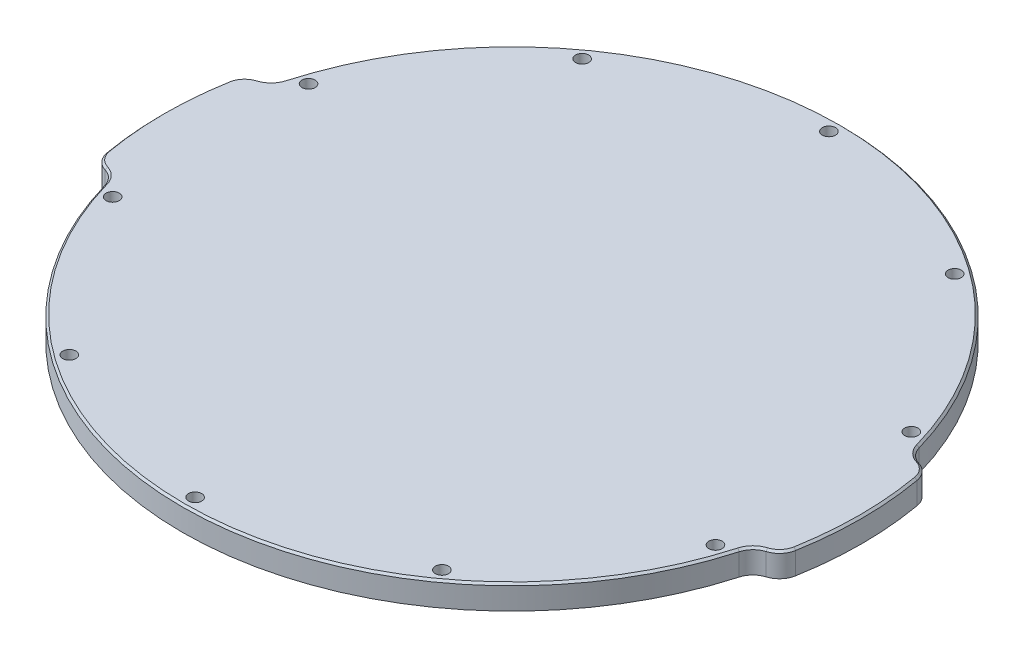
ISO-10303-21;
HEADER;
FILE_DESCRIPTION(('STEP AP214'),'2;1');
FILE_NAME('part.step','',(''),(''),'','','');
FILE_SCHEMA(('AUTOMOTIVE_DESIGN { 1 0 10303 214 1 1 1 1 }'));
ENDSEC;
DATA;
#1=APPLICATION_CONTEXT('core data for automotive mechanical design processes');
#2=APPLICATION_PROTOCOL_DEFINITION('international standard','automotive_design',2000,#1);
#3=PRODUCT_CONTEXT('',#1,'mechanical');
#4=PRODUCT('Part','Part','',(#3));
#5=PRODUCT_RELATED_PRODUCT_CATEGORY('part','',(#4));
#6=PRODUCT_DEFINITION_FORMATION('','',#4);
#7=PRODUCT_DEFINITION_CONTEXT('part definition',#1,'design');
#8=PRODUCT_DEFINITION('design','',#6,#7);
#9=PRODUCT_DEFINITION_SHAPE('','',#8);
#10=(LENGTH_UNIT() NAMED_UNIT(*) SI_UNIT(.MILLI.,.METRE.));
#11=(NAMED_UNIT(*) PLANE_ANGLE_UNIT() SI_UNIT($,.RADIAN.));
#12=(NAMED_UNIT(*) SI_UNIT($,.STERADIAN.) SOLID_ANGLE_UNIT());
#13=UNCERTAINTY_MEASURE_WITH_UNIT(LENGTH_MEASURE(1.E-05),#10,'distance_accuracy_value','');
#14=(GEOMETRIC_REPRESENTATION_CONTEXT(3) GLOBAL_UNCERTAINTY_ASSIGNED_CONTEXT((#13)) GLOBAL_UNIT_ASSIGNED_CONTEXT((#10,
#11,#12)) REPRESENTATION_CONTEXT('',''));
#15=CARTESIAN_POINT('',(0.,0.,0.));
#16=DIRECTION('',(0.,0.,1.));
#17=DIRECTION('',(1.,0.,0.));
#18=AXIS2_PLACEMENT_3D('',#15,#16,#17);
#19=CARTESIAN_POINT('',(-40.6479400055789,6.,-7.16732853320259));
#20=DIRECTION('',(0.,-1.,0.));
#21=DIRECTION('',(0.,0.,-1.));
#22=AXIS2_PLACEMENT_3D('',#19,#20,#21);
#23=PLANE('',#22);
#24=CARTESIAN_POINT('',(-84.2258492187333,6.,23.8957909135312));
#25=DIRECTION('',(0.,-1.,0.));
#26=DIRECTION('',(0.,0.,-1.));
#27=AXIS2_PLACEMENT_3D('',#24,#25,#26);
#28=CIRCLE('',#27,5.49999999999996);
#29=CARTESIAN_POINT('',(-82.6143661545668,6.,18.6371672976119));
#30=VERTEX_POINT('',#29);
#31=CARTESIAN_POINT('',(-78.9346765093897,6.,22.3946275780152));
#32=VERTEX_POINT('',#31);
#33=EDGE_CURVE('E296',#30,#32,#28,.T.);
#34=ORIENTED_EDGE('',*,*,#33,.T.);
#35=CARTESIAN_POINT('',(0.,6.,-4.92661467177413E-13));
#36=DIRECTION('',(0.,-1.,0.));
#37=DIRECTION('',(0.,0.,-1.));
#38=AXIS2_PLACEMENT_3D('',#35,#36,#37);
#39=CIRCLE('',#38,82.0500000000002);
#40=CARTESIAN_POINT('',(78.9346765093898,6.,22.3946275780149));
#41=VERTEX_POINT('',#40);
#42=EDGE_CURVE('E302',#32,#41,#39,.F.);
#43=ORIENTED_EDGE('',*,*,#42,.T.);
#44=CARTESIAN_POINT('',(84.2258492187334,6.,23.8957909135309));
#45=DIRECTION('',(0.,-1.,0.));
#46=DIRECTION('',(0.,0.,-1.));
#47=AXIS2_PLACEMENT_3D('',#44,#45,#46);
#48=CIRCLE('',#47,5.49999999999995);
#49=CARTESIAN_POINT('',(82.6143661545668,6.,18.6371672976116));
#50=VERTEX_POINT('',#49);
#51=EDGE_CURVE('E299',#41,#50,#48,.T.);
#52=ORIENTED_EDGE('',*,*,#51,.T.);
#53=CARTESIAN_POINT('',(81.2958800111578,6.,14.3346570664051));
#54=DIRECTION('',(0.,-1.,0.));
#55=DIRECTION('',(0.,0.,-1.));
#56=AXIS2_PLACEMENT_3D('',#53,#54,#55);
#57=CIRCLE('',#56,4.49999999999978);
#58=CARTESIAN_POINT('',(85.7275148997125,6.,15.1160738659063));
#59=VERTEX_POINT('',#58);
#60=EDGE_CURVE('E293',#50,#59,#57,.F.);
#61=ORIENTED_EDGE('',*,*,#60,.T.);
#62=CARTESIAN_POINT('',(-1.29063426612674E-12,6.,0.));
#63=DIRECTION('',(0.,-1.,0.));
#64=DIRECTION('',(0.,0.,-1.));
#65=AXIS2_PLACEMENT_3D('',#62,#63,#64);
#66=CIRCLE('',#65,87.0500000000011);
#67=CARTESIAN_POINT('',(85.7275148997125,6.,-15.1160738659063));
#68=VERTEX_POINT('',#67);
#69=EDGE_CURVE('E287',#59,#68,#66,.F.);
#70=ORIENTED_EDGE('',*,*,#69,.T.);
#71=CARTESIAN_POINT('',(81.2958800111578,6.,-14.3346570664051));
#72=DIRECTION('',(0.,-1.,0.));
#73=DIRECTION('',(0.,0.,-1.));
#74=AXIS2_PLACEMENT_3D('',#71,#72,#73);
#75=CIRCLE('',#74,4.49999999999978);
#76=CARTESIAN_POINT('',(82.6143661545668,6.,-18.6371672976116));
#77=VERTEX_POINT('',#76);
#78=EDGE_CURVE('E281',#68,#77,#75,.F.);
#79=ORIENTED_EDGE('',*,*,#78,.T.);
#80=CARTESIAN_POINT('',(84.2258492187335,6.,-23.8957909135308));
#81=DIRECTION('',(0.,-1.,0.));
#82=DIRECTION('',(0.,0.,-1.));
#83=AXIS2_PLACEMENT_3D('',#80,#81,#82);
#84=CIRCLE('',#83,5.49999999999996);
#85=CARTESIAN_POINT('',(78.9346765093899,6.,-22.3946275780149));
#86=VERTEX_POINT('',#85);
#87=EDGE_CURVE('E275',#77,#86,#84,.T.);
#88=ORIENTED_EDGE('',*,*,#87,.T.);
#89=CARTESIAN_POINT('',(0.,6.,0.));
#90=DIRECTION('',(0.,-1.,0.));
#91=DIRECTION('',(0.,0.,-1.));
#92=AXIS2_PLACEMENT_3D('',#89,#90,#91);
#93=CIRCLE('',#92,82.05);
#94=CARTESIAN_POINT('',(-78.9346765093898,6.,-22.3946275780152));
#95=VERTEX_POINT('',#94);
#96=EDGE_CURVE('E269',#86,#95,#93,.F.);
#97=ORIENTED_EDGE('',*,*,#96,.T.);
#98=CARTESIAN_POINT('',(-84.2258492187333,6.,-23.8957909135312));
#99=DIRECTION('',(0.,-1.,0.));
#100=DIRECTION('',(0.,0.,-1.));
#101=AXIS2_PLACEMENT_3D('',#98,#99,#100);
#102=CIRCLE('',#101,5.49999999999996);
#103=CARTESIAN_POINT('',(-82.6143661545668,6.,-18.6371672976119));
#104=VERTEX_POINT('',#103);
#105=EDGE_CURVE('E272',#95,#104,#102,.T.);
#106=ORIENTED_EDGE('',*,*,#105,.T.);
#107=CARTESIAN_POINT('',(-81.2958800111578,6.,-14.3346570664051));
#108=DIRECTION('',(0.,-1.,0.));
#109=DIRECTION('',(0.,0.,-1.));
#110=AXIS2_PLACEMENT_3D('',#107,#108,#109);
#111=CIRCLE('',#110,4.50000000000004);
#112=CARTESIAN_POINT('',(-85.7275148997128,6.,-15.1160738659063));
#113=VERTEX_POINT('',#112);
#114=EDGE_CURVE('E278',#104,#113,#111,.F.);
#115=ORIENTED_EDGE('',*,*,#114,.T.);
#116=CARTESIAN_POINT('',(0.,6.,0.));
#117=DIRECTION('',(0.,-1.,0.));
#118=DIRECTION('',(0.,0.,-1.));
#119=AXIS2_PLACEMENT_3D('',#116,#117,#118);
#120=CIRCLE('',#119,87.05);
#121=CARTESIAN_POINT('',(-85.7275148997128,6.,15.1160738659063));
#122=VERTEX_POINT('',#121);
#123=EDGE_CURVE('E284',#113,#122,#120,.F.);
#124=ORIENTED_EDGE('',*,*,#123,.T.);
#125=CARTESIAN_POINT('',(-81.2958800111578,6.,14.3346570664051));
#126=DIRECTION('',(0.,-1.,0.));
#127=DIRECTION('',(0.,0.,-1.));
#128=AXIS2_PLACEMENT_3D('',#125,#126,#127);
#129=CIRCLE('',#128,4.50000000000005);
#130=EDGE_CURVE('E290',#122,#30,#129,.F.);
#131=ORIENTED_EDGE('',*,*,#130,.T.);
#132=EDGE_LOOP('',(#34,#43,#52,#61,#70,#79,#88,#97,#106,#115,#124,#131));
#133=FACE_BOUND('',#132,.T.);
#134=CARTESIAN_POINT('',(-75.4663345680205,6.,-24.5204985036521));
#135=DIRECTION('',(0.,1.,0.));
#136=DIRECTION('',(0.,0.,1.));
#137=AXIS2_PLACEMENT_3D('',#134,#135,#136);
#138=CIRCLE('',#137,1.6500000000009);
#139=CARTESIAN_POINT('',(-75.4663345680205,6.,-22.8704985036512));
#140=VERTEX_POINT('',#139);
#141=EDGE_CURVE('E400',#140,#140,#138,.T.);
#142=ORIENTED_EDGE('',*,*,#141,.F.);
#143=EDGE_LOOP('',(#142));
#144=FACE_BOUND('',#143,.T.);
#145=CARTESIAN_POINT('',(-46.6407597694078,6.,64.1954985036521));
#146=DIRECTION('',(0.,1.,0.));
#147=DIRECTION('',(0.,0.,1.));
#148=AXIS2_PLACEMENT_3D('',#145,#146,#147);
#149=CIRCLE('',#148,1.65000000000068);
#150=CARTESIAN_POINT('',(-46.6407597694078,6.,65.8454985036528));
#151=VERTEX_POINT('',#150);
#152=EDGE_CURVE('E416',#151,#151,#149,.T.);
#153=ORIENTED_EDGE('',*,*,#152,.F.);
#154=EDGE_LOOP('',(#153));
#155=FACE_BOUND('',#154,.T.);
#156=CARTESIAN_POINT('',(46.6407597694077,6.,64.1954985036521));
#157=DIRECTION('',(0.,1.,0.));
#158=DIRECTION('',(0.,0.,1.));
#159=AXIS2_PLACEMENT_3D('',#156,#157,#158);
#160=CIRCLE('',#159,1.65000000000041);
#161=CARTESIAN_POINT('',(46.6407597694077,6.,65.8454985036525));
#162=VERTEX_POINT('',#161);
#163=EDGE_CURVE('E431',#162,#162,#160,.T.);
#164=ORIENTED_EDGE('',*,*,#163,.F.);
#165=EDGE_LOOP('',(#164));
#166=FACE_BOUND('',#165,.T.);
#167=CARTESIAN_POINT('',(75.4663345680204,6.,-24.5204985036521));
#168=DIRECTION('',(0.,1.,0.));
#169=DIRECTION('',(0.,0.,1.));
#170=AXIS2_PLACEMENT_3D('',#167,#168,#169);
#171=CIRCLE('',#170,1.65000000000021);
#172=CARTESIAN_POINT('',(75.4663345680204,6.,-22.8704985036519));
#173=VERTEX_POINT('',#172);
#174=EDGE_CURVE('E447',#173,#173,#171,.T.);
#175=ORIENTED_EDGE('',*,*,#174,.F.);
#176=EDGE_LOOP('',(#175));
#177=FACE_BOUND('',#176,.T.);
#178=CARTESIAN_POINT('',(0.,6.,-79.35));
#179=DIRECTION('',(0.,1.,0.));
#180=DIRECTION('',(0.,0.,1.));
#181=AXIS2_PLACEMENT_3D('',#178,#179,#180);
#182=CIRCLE('',#181,1.65);
#183=CARTESIAN_POINT('',(0.,6.,-77.7));
#184=VERTEX_POINT('',#183);
#185=EDGE_CURVE('E192',#184,#184,#182,.T.);
#186=ORIENTED_EDGE('',*,*,#185,.F.);
#187=EDGE_LOOP('',(#186));
#188=FACE_BOUND('',#187,.T.);
#189=CARTESIAN_POINT('',(46.6407597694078,6.,-64.1954985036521));
#190=DIRECTION('',(0.,1.,0.));
#191=DIRECTION('',(0.,0.,1.));
#192=AXIS2_PLACEMENT_3D('',#189,#190,#191);
#193=CIRCLE('',#192,1.65000000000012);
#194=CARTESIAN_POINT('',(46.6407597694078,6.,-62.5454985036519));
#195=VERTEX_POINT('',#194);
#196=EDGE_CURVE('E455',#195,#195,#193,.T.);
#197=ORIENTED_EDGE('',*,*,#196,.F.);
#198=EDGE_LOOP('',(#197));
#199=FACE_BOUND('',#198,.T.);
#200=CARTESIAN_POINT('',(75.4663345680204,6.,24.5204985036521));
#201=DIRECTION('',(0.,1.,0.));
#202=DIRECTION('',(0.,0.,1.));
#203=AXIS2_PLACEMENT_3D('',#200,#201,#202);
#204=CIRCLE('',#203,1.65000000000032);
#205=CARTESIAN_POINT('',(75.4663345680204,6.,26.1704985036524));
#206=VERTEX_POINT('',#205);
#207=EDGE_CURVE('E439',#206,#206,#204,.T.);
#208=ORIENTED_EDGE('',*,*,#207,.F.);
#209=EDGE_LOOP('',(#208));
#210=FACE_BOUND('',#209,.T.);
#211=CARTESIAN_POINT('',(0.,6.,79.35));
#212=DIRECTION('',(0.,1.,0.));
#213=DIRECTION('',(0.,0.,1.));
#214=AXIS2_PLACEMENT_3D('',#211,#212,#213);
#215=CIRCLE('',#214,1.65000000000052);
#216=CARTESIAN_POINT('',(0.,6.,81.0000000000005));
#217=VERTEX_POINT('',#216);
#218=EDGE_CURVE('E424',#217,#217,#215,.T.);
#219=ORIENTED_EDGE('',*,*,#218,.F.);
#220=EDGE_LOOP('',(#219));
#221=FACE_BOUND('',#220,.T.);
#222=CARTESIAN_POINT('',(-75.4663345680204,6.,24.5204985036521));
#223=DIRECTION('',(0.,1.,0.));
#224=DIRECTION('',(0.,0.,1.));
#225=AXIS2_PLACEMENT_3D('',#222,#223,#224);
#226=CIRCLE('',#225,1.65000000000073);
#227=CARTESIAN_POINT('',(-75.4663345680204,6.,26.1704985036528));
#228=VERTEX_POINT('',#227);
#229=EDGE_CURVE('E408',#228,#228,#226,.T.);
#230=ORIENTED_EDGE('',*,*,#229,.F.);
#231=EDGE_LOOP('',(#230));
#232=FACE_BOUND('',#231,.T.);
#233=CARTESIAN_POINT('',(-46.6407597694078,6.,-64.1954985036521));
#234=DIRECTION('',(0.,1.,0.));
#235=DIRECTION('',(0.,0.,1.));
#236=AXIS2_PLACEMENT_3D('',#233,#234,#235);
#237=CIRCLE('',#236,1.65000000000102);
#238=CARTESIAN_POINT('',(-46.6407597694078,6.,-62.545498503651));
#239=VERTEX_POINT('',#238);
#240=EDGE_CURVE('E390',#239,#239,#237,.T.);
#241=ORIENTED_EDGE('',*,*,#240,.F.);
#242=EDGE_LOOP('',(#241));
#243=FACE_BOUND('',#242,.T.);
#244=ADVANCED_FACE('F43',(#133,#144,#155,#166,#177,#188,#199,#210,#221,#232,#243),#23,.F.);
#245=CARTESIAN_POINT('',(-40.6479400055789,0.,-7.16732853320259));
#246=DIRECTION('',(0.,-1.,0.));
#247=DIRECTION('',(0.,0.,-1.));
#248=AXIS2_PLACEMENT_3D('',#245,#246,#247);
#249=PLANE('',#248);
#250=CARTESIAN_POINT('',(-75.4663345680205,0.,-24.5204985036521));
#251=DIRECTION('',(0.,1.,0.));
#252=DIRECTION('',(0.,0.,1.));
#253=AXIS2_PLACEMENT_3D('',#250,#251,#252);
#254=CIRCLE('',#253,1.6500000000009);
#255=CARTESIAN_POINT('',(-75.4663345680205,0.,-22.8704985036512));
#256=VERTEX_POINT('',#255);
#257=EDGE_CURVE('E397',#256,#256,#254,.T.);
#258=ORIENTED_EDGE('',*,*,#257,.T.);
#259=EDGE_LOOP('',(#258));
#260=FACE_BOUND('',#259,.T.);
#261=CARTESIAN_POINT('',(-46.6407597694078,0.,64.1954985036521));
#262=DIRECTION('',(0.,1.,0.));
#263=DIRECTION('',(0.,0.,1.));
#264=AXIS2_PLACEMENT_3D('',#261,#262,#263);
#265=CIRCLE('',#264,1.65000000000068);
#266=CARTESIAN_POINT('',(-46.6407597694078,0.,65.8454985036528));
#267=VERTEX_POINT('',#266);
#268=EDGE_CURVE('E412',#267,#267,#265,.T.);
#269=ORIENTED_EDGE('',*,*,#268,.T.);
#270=EDGE_LOOP('',(#269));
#271=FACE_BOUND('',#270,.T.);
#272=CARTESIAN_POINT('',(46.6407597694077,0.,64.1954985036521));
#273=DIRECTION('',(0.,1.,0.));
#274=DIRECTION('',(0.,0.,1.));
#275=AXIS2_PLACEMENT_3D('',#272,#273,#274);
#276=CIRCLE('',#275,1.65000000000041);
#277=CARTESIAN_POINT('',(46.6407597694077,0.,65.8454985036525));
#278=VERTEX_POINT('',#277);
#279=EDGE_CURVE('E427',#278,#278,#276,.T.);
#280=ORIENTED_EDGE('',*,*,#279,.T.);
#281=EDGE_LOOP('',(#280));
#282=FACE_BOUND('',#281,.T.);
#283=CARTESIAN_POINT('',(75.4663345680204,0.,-24.5204985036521));
#284=DIRECTION('',(0.,1.,0.));
#285=DIRECTION('',(0.,0.,1.));
#286=AXIS2_PLACEMENT_3D('',#283,#284,#285);
#287=CIRCLE('',#286,1.65000000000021);
#288=CARTESIAN_POINT('',(75.4663345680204,0.,-22.8704985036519));
#289=VERTEX_POINT('',#288);
#290=EDGE_CURVE('E443',#289,#289,#287,.T.);
#291=ORIENTED_EDGE('',*,*,#290,.T.);
#292=EDGE_LOOP('',(#291));
#293=FACE_BOUND('',#292,.T.);
#294=CARTESIAN_POINT('',(0.,0.,-79.35));
#295=DIRECTION('',(0.,1.,0.));
#296=DIRECTION('',(0.,0.,1.));
#297=AXIS2_PLACEMENT_3D('',#294,#295,#296);
#298=CIRCLE('',#297,1.65);
#299=CARTESIAN_POINT('',(0.,0.,-77.7));
#300=VERTEX_POINT('',#299);
#301=EDGE_CURVE('E459',#300,#300,#298,.T.);
#302=ORIENTED_EDGE('',*,*,#301,.T.);
#303=EDGE_LOOP('',(#302));
#304=FACE_BOUND('',#303,.T.);
#305=CARTESIAN_POINT('',(-81.2958800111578,0.,-14.3346570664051));
#306=DIRECTION('',(0.,1.,0.));
#307=DIRECTION('',(0.,0.,-1.));
#308=AXIS2_PLACEMENT_3D('',#305,#306,#307);
#309=CIRCLE('',#308,5.00000000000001);
#310=CARTESIAN_POINT('',(-82.7608646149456,0.,-19.1152239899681));
#311=VERTEX_POINT('',#310);
#312=CARTESIAN_POINT('',(-86.2199187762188,0.,-15.2028979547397));
#313=VERTEX_POINT('',#312);
#314=EDGE_CURVE('E186',#311,#313,#309,.T.);
#315=ORIENTED_EDGE('',*,*,#314,.F.);
#316=CARTESIAN_POINT('',(-84.2258492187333,0.,-23.8957909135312));
#317=DIRECTION('',(0.,-1.,0.));
#318=DIRECTION('',(0.,0.,-1.));
#319=AXIS2_PLACEMENT_3D('',#316,#317,#318);
#320=CIRCLE('',#319,5.);
#321=CARTESIAN_POINT('',(-79.4156922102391,0.,-22.531096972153));
#322=VERTEX_POINT('',#321);
#323=EDGE_CURVE('E263',#311,#322,#320,.F.);
#324=ORIENTED_EDGE('',*,*,#323,.T.);
#325=CARTESIAN_POINT('',(0.,0.,0.));
#326=DIRECTION('',(0.,1.,0.));
#327=DIRECTION('',(0.,0.,-1.));
#328=AXIS2_PLACEMENT_3D('',#325,#326,#327);
#329=CIRCLE('',#328,82.55);
#330=CARTESIAN_POINT('',(79.4156922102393,0.,-22.5310969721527));
#331=VERTEX_POINT('',#330);
#332=EDGE_CURVE('E222',#331,#322,#329,.T.);
#333=ORIENTED_EDGE('',*,*,#332,.F.);
#334=CARTESIAN_POINT('',(84.2258492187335,0.,-23.8957909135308));
#335=DIRECTION('',(0.,-1.,0.));
#336=DIRECTION('',(0.,0.,-1.));
#337=AXIS2_PLACEMENT_3D('',#334,#335,#336);
#338=CIRCLE('',#337,5.);
#339=CARTESIAN_POINT('',(82.7608646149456,0.,-19.1152239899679));
#340=VERTEX_POINT('',#339);
#341=EDGE_CURVE('E260',#331,#340,#338,.F.);
#342=ORIENTED_EDGE('',*,*,#341,.T.);
#343=CARTESIAN_POINT('',(81.2958800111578,0.,-14.3346570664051));
#344=DIRECTION('',(0.,1.,0.));
#345=DIRECTION('',(0.,0.,1.));
#346=AXIS2_PLACEMENT_3D('',#343,#344,#345);
#347=CIRCLE('',#346,4.99999999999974);
#348=CARTESIAN_POINT('',(86.2199187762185,0.,-15.2028979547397));
#349=VERTEX_POINT('',#348);
#350=EDGE_CURVE('E218',#349,#340,#347,.T.);
#351=ORIENTED_EDGE('',*,*,#350,.F.);
#352=CARTESIAN_POINT('',(-1.29063426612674E-12,0.,0.));
#353=DIRECTION('',(0.,1.,0.));
#354=DIRECTION('',(0.,0.,1.));
#355=AXIS2_PLACEMENT_3D('',#352,#353,#354);
#356=CIRCLE('',#355,87.550000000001);
#357=CARTESIAN_POINT('',(86.2199187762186,0.,15.2028979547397));
#358=VERTEX_POINT('',#357);
#359=EDGE_CURVE('E214',#358,#349,#356,.T.);
#360=ORIENTED_EDGE('',*,*,#359,.F.);
#361=CARTESIAN_POINT('',(81.2958800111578,0.,14.3346570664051));
#362=DIRECTION('',(0.,1.,0.));
#363=DIRECTION('',(0.,0.,-1.));
#364=AXIS2_PLACEMENT_3D('',#361,#362,#363);
#365=CIRCLE('',#364,4.99999999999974);
#366=CARTESIAN_POINT('',(82.7608646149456,0.,19.1152239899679));
#367=VERTEX_POINT('',#366);
#368=EDGE_CURVE('E210',#367,#358,#365,.T.);
#369=ORIENTED_EDGE('',*,*,#368,.F.);
#370=CARTESIAN_POINT('',(84.2258492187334,0.,23.8957909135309));
#371=DIRECTION('',(0.,-1.,0.));
#372=DIRECTION('',(0.,0.,-1.));
#373=AXIS2_PLACEMENT_3D('',#370,#371,#372);
#374=CIRCLE('',#373,5.);
#375=CARTESIAN_POINT('',(79.4156922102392,0.,22.5310969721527));
#376=VERTEX_POINT('',#375);
#377=EDGE_CURVE('E257',#367,#376,#374,.F.);
#378=ORIENTED_EDGE('',*,*,#377,.T.);
#379=CARTESIAN_POINT('',(0.,0.,-4.92661467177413E-13));
#380=DIRECTION('',(0.,1.,0.));
#381=DIRECTION('',(0.,0.,-1.));
#382=AXIS2_PLACEMENT_3D('',#379,#380,#381);
#383=CIRCLE('',#382,82.5500000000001);
#384=CARTESIAN_POINT('',(-79.4156922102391,0.,22.531096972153));
#385=VERTEX_POINT('',#384);
#386=EDGE_CURVE('E203',#385,#376,#383,.T.);
#387=ORIENTED_EDGE('',*,*,#386,.F.);
#388=CARTESIAN_POINT('',(-84.2258492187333,0.,23.8957909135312));
#389=DIRECTION('',(0.,-1.,0.));
#390=DIRECTION('',(0.,0.,-1.));
#391=AXIS2_PLACEMENT_3D('',#388,#389,#390);
#392=CIRCLE('',#391,5.);
#393=CARTESIAN_POINT('',(-82.7608646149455,0.,19.1152239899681));
#394=VERTEX_POINT('',#393);
#395=EDGE_CURVE('E266',#385,#394,#392,.F.);
#396=ORIENTED_EDGE('',*,*,#395,.T.);
#397=CARTESIAN_POINT('',(-81.2958800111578,0.,14.3346570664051));
#398=DIRECTION('',(0.,1.,0.));
#399=DIRECTION('',(0.,0.,1.));
#400=AXIS2_PLACEMENT_3D('',#397,#398,#399);
#401=CIRCLE('',#400,5.00000000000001);
#402=CARTESIAN_POINT('',(-86.2199187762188,0.,15.2028979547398));
#403=VERTEX_POINT('',#402);
#404=EDGE_CURVE('E197',#403,#394,#401,.T.);
#405=ORIENTED_EDGE('',*,*,#404,.F.);
#406=CARTESIAN_POINT('',(0.,0.,0.));
#407=DIRECTION('',(0.,1.,0.));
#408=DIRECTION('',(0.,0.,-1.));
#409=AXIS2_PLACEMENT_3D('',#406,#407,#408);
#410=CIRCLE('',#409,87.55);
#411=EDGE_CURVE('E175',#313,#403,#410,.T.);
#412=ORIENTED_EDGE('',*,*,#411,.F.);
#413=EDGE_LOOP('',(#315,#324,#333,#342,#351,#360,#369,#378,#387,#396,#405,#412));
#414=FACE_BOUND('',#413,.T.);
#415=CARTESIAN_POINT('',(46.6407597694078,0.,-64.1954985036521));
#416=DIRECTION('',(0.,1.,0.));
#417=DIRECTION('',(0.,0.,1.));
#418=AXIS2_PLACEMENT_3D('',#415,#416,#417);
#419=CIRCLE('',#418,1.65000000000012);
#420=CARTESIAN_POINT('',(46.6407597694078,0.,-62.5454985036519));
#421=VERTEX_POINT('',#420);
#422=EDGE_CURVE('E451',#421,#421,#419,.T.);
#423=ORIENTED_EDGE('',*,*,#422,.T.);
#424=EDGE_LOOP('',(#423));
#425=FACE_BOUND('',#424,.T.);
#426=CARTESIAN_POINT('',(75.4663345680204,0.,24.5204985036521));
#427=DIRECTION('',(0.,1.,0.));
#428=DIRECTION('',(0.,0.,1.));
#429=AXIS2_PLACEMENT_3D('',#426,#427,#428);
#430=CIRCLE('',#429,1.65000000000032);
#431=CARTESIAN_POINT('',(75.4663345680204,0.,26.1704985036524));
#432=VERTEX_POINT('',#431);
#433=EDGE_CURVE('E435',#432,#432,#430,.T.);
#434=ORIENTED_EDGE('',*,*,#433,.T.);
#435=EDGE_LOOP('',(#434));
#436=FACE_BOUND('',#435,.T.);
#437=CARTESIAN_POINT('',(0.,0.,79.35));
#438=DIRECTION('',(0.,1.,0.));
#439=DIRECTION('',(0.,0.,1.));
#440=AXIS2_PLACEMENT_3D('',#437,#438,#439);
#441=CIRCLE('',#440,1.65000000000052);
#442=CARTESIAN_POINT('',(0.,0.,81.0000000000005));
#443=VERTEX_POINT('',#442);
#444=EDGE_CURVE('E420',#443,#443,#441,.T.);
#445=ORIENTED_EDGE('',*,*,#444,.T.);
#446=EDGE_LOOP('',(#445));
#447=FACE_BOUND('',#446,.T.);
#448=CARTESIAN_POINT('',(-75.4663345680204,0.,24.5204985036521));
#449=DIRECTION('',(0.,1.,0.));
#450=DIRECTION('',(0.,0.,1.));
#451=AXIS2_PLACEMENT_3D('',#448,#449,#450);
#452=CIRCLE('',#451,1.65000000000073);
#453=CARTESIAN_POINT('',(-75.4663345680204,0.,26.1704985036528));
#454=VERTEX_POINT('',#453);
#455=EDGE_CURVE('E404',#454,#454,#452,.T.);
#456=ORIENTED_EDGE('',*,*,#455,.T.);
#457=EDGE_LOOP('',(#456));
#458=FACE_BOUND('',#457,.T.);
#459=CARTESIAN_POINT('',(-46.6407597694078,0.,-64.1954985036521));
#460=DIRECTION('',(0.,1.,0.));
#461=DIRECTION('',(0.,0.,1.));
#462=AXIS2_PLACEMENT_3D('',#459,#460,#461);
#463=CIRCLE('',#462,1.65000000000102);
#464=CARTESIAN_POINT('',(-46.6407597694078,0.,-62.545498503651));
#465=VERTEX_POINT('',#464);
#466=EDGE_CURVE('E384',#465,#465,#463,.T.);
#467=ORIENTED_EDGE('',*,*,#466,.T.);
#468=EDGE_LOOP('',(#467));
#469=FACE_BOUND('',#468,.T.);
#470=ADVANCED_FACE('F194',(#260,#271,#282,#293,#304,#414,#425,#436,#447,#458,#469),#249,.T.);
#471=CARTESIAN_POINT('',(-81.2958800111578,6.,-14.3346570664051));
#472=DIRECTION('',(0.,-1.,0.));
#473=DIRECTION('',(0.,0.,-1.));
#474=AXIS2_PLACEMENT_3D('',#471,#472,#473);
#475=CYLINDRICAL_SURFACE('',#474,5.00000000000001);
#476=DIRECTION('',(0.,-1.,0.));
#477=VECTOR('',#476,1.);
#478=CARTESIAN_POINT('',(-86.2199187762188,6.,-15.2028979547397));
#479=LINE('',#478,#477);
#480=CARTESIAN_POINT('',(-86.2199187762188,5.50000000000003,-15.2028979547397));
#481=VERTEX_POINT('',#480);
#482=EDGE_CURVE('E170',#481,#313,#479,.T.);
#483=ORIENTED_EDGE('',*,*,#482,.F.);
#484=CARTESIAN_POINT('',(-81.2958800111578,5.50000000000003,-14.3346570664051));
#485=DIRECTION('',(0.,-1.,0.));
#486=DIRECTION('',(0.,0.,-1.));
#487=AXIS2_PLACEMENT_3D('',#484,#485,#486);
#488=CIRCLE('',#487,5.00000000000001);
#489=CARTESIAN_POINT('',(-82.7608646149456,5.50000000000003,-19.1152239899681));
#490=VERTEX_POINT('',#489);
#491=EDGE_CURVE('E330',#481,#490,#488,.T.);
#492=ORIENTED_EDGE('',*,*,#491,.T.);
#493=DIRECTION('',(0.,-1.,0.));
#494=VECTOR('',#493,1.);
#495=CARTESIAN_POINT('',(-82.7608646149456,6.,-19.1152239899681));
#496=LINE('',#495,#494);
#497=EDGE_CURVE('E188',#490,#311,#496,.T.);
#498=ORIENTED_EDGE('',*,*,#497,.T.);
#499=ORIENTED_EDGE('',*,*,#314,.T.);
#500=EDGE_LOOP('',(#483,#492,#498,#499));
#501=FACE_BOUND('',#500,.T.);
#502=ADVANCED_FACE('F187',(#501),#475,.T.);
#503=CARTESIAN_POINT('',(0.,6.,0.));
#504=DIRECTION('',(0.,-1.,0.));
#505=DIRECTION('',(0.,0.,-1.));
#506=AXIS2_PLACEMENT_3D('',#503,#504,#505);
#507=CYLINDRICAL_SURFACE('',#506,87.55);
#508=DIRECTION('',(0.,-1.,0.));
#509=VECTOR('',#508,1.);
#510=CARTESIAN_POINT('',(-86.2199187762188,6.,15.2028979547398));
#511=LINE('',#510,#509);
#512=CARTESIAN_POINT('',(-86.2199187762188,5.50000000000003,15.2028979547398));
#513=VERTEX_POINT('',#512);
#514=EDGE_CURVE('E183',#513,#403,#511,.T.);
#515=ORIENTED_EDGE('',*,*,#514,.F.);
#516=CARTESIAN_POINT('',(0.,5.50000000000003,0.));
#517=DIRECTION('',(0.,-1.,0.));
#518=DIRECTION('',(0.,0.,-1.));
#519=AXIS2_PLACEMENT_3D('',#516,#517,#518);
#520=CIRCLE('',#519,87.55);
#521=EDGE_CURVE('E178',#513,#481,#520,.T.);
#522=ORIENTED_EDGE('',*,*,#521,.T.);
#523=ORIENTED_EDGE('',*,*,#482,.T.);
#524=ORIENTED_EDGE('',*,*,#411,.T.);
#525=EDGE_LOOP('',(#515,#522,#523,#524));
#526=FACE_BOUND('',#525,.T.);
#527=ADVANCED_FACE('F173',(#526),#507,.T.);
#528=CARTESIAN_POINT('',(-81.2958800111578,6.,14.3346570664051));
#529=DIRECTION('',(0.,-1.,0.));
#530=DIRECTION('',(0.,0.,-1.));
#531=AXIS2_PLACEMENT_3D('',#528,#529,#530);
#532=CYLINDRICAL_SURFACE('',#531,5.00000000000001);
#533=DIRECTION('',(0.,-1.,0.));
#534=VECTOR('',#533,1.);
#535=CARTESIAN_POINT('',(-82.7608646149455,6.,19.1152239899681));
#536=LINE('',#535,#534);
#537=CARTESIAN_POINT('',(-82.7608646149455,5.50000000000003,19.1152239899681));
#538=VERTEX_POINT('',#537);
#539=EDGE_CURVE('E253',#394,#538,#536,.F.);
#540=ORIENTED_EDGE('',*,*,#539,.T.);
#541=CARTESIAN_POINT('',(-81.2958800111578,5.50000000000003,14.3346570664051));
#542=DIRECTION('',(0.,-1.,0.));
#543=DIRECTION('',(0.,0.,-1.));
#544=AXIS2_PLACEMENT_3D('',#541,#542,#543);
#545=CIRCLE('',#544,5.00000000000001);
#546=EDGE_CURVE('E319',#538,#513,#545,.T.);
#547=ORIENTED_EDGE('',*,*,#546,.T.);
#548=ORIENTED_EDGE('',*,*,#514,.T.);
#549=ORIENTED_EDGE('',*,*,#404,.T.);
#550=EDGE_LOOP('',(#540,#547,#548,#549));
#551=FACE_BOUND('',#550,.T.);
#552=ADVANCED_FACE('F509',(#551),#532,.T.);
#553=CARTESIAN_POINT('',(0.,6.,-4.92661467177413E-13));
#554=DIRECTION('',(0.,-1.,0.));
#555=DIRECTION('',(0.,0.,-1.));
#556=AXIS2_PLACEMENT_3D('',#553,#554,#555);
#557=CYLINDRICAL_SURFACE('',#556,82.5500000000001);
#558=DIRECTION('',(0.,-1.,0.));
#559=VECTOR('',#558,1.);
#560=CARTESIAN_POINT('',(79.4156922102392,6.,22.5310969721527));
#561=LINE('',#560,#559);
#562=CARTESIAN_POINT('',(79.4156922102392,5.50000000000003,22.5310969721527));
#563=VERTEX_POINT('',#562);
#564=EDGE_CURVE('E238',#376,#563,#561,.F.);
#565=ORIENTED_EDGE('',*,*,#564,.T.);
#566=CARTESIAN_POINT('',(0.,5.50000000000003,-4.92661467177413E-13));
#567=DIRECTION('',(0.,-1.,0.));
#568=DIRECTION('',(0.,0.,-1.));
#569=AXIS2_PLACEMENT_3D('',#566,#567,#568);
#570=CIRCLE('',#569,82.5500000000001);
#571=CARTESIAN_POINT('',(-79.4156922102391,5.50000000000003,22.531096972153));
#572=VERTEX_POINT('',#571);
#573=EDGE_CURVE('E306',#563,#572,#570,.T.);
#574=ORIENTED_EDGE('',*,*,#573,.T.);
#575=DIRECTION('',(0.,-1.,0.));
#576=VECTOR('',#575,1.);
#577=CARTESIAN_POINT('',(-79.4156922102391,6.,22.531096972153));
#578=LINE('',#577,#576);
#579=EDGE_CURVE('E235',#572,#385,#578,.T.);
#580=ORIENTED_EDGE('',*,*,#579,.T.);
#581=ORIENTED_EDGE('',*,*,#386,.T.);
#582=EDGE_LOOP('',(#565,#574,#580,#581));
#583=FACE_BOUND('',#582,.T.);
#584=ADVANCED_FACE('F505',(#583),#557,.T.);
#585=CARTESIAN_POINT('',(81.2958800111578,6.,14.3346570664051));
#586=DIRECTION('',(0.,-1.,0.));
#587=DIRECTION('',(0.,0.,-1.));
#588=AXIS2_PLACEMENT_3D('',#585,#586,#587);
#589=CYLINDRICAL_SURFACE('',#588,4.99999999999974);
#590=DIRECTION('',(0.,-1.,0.));
#591=VECTOR('',#590,1.);
#592=CARTESIAN_POINT('',(86.2199187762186,6.,15.2028979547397));
#593=LINE('',#592,#591);
#594=CARTESIAN_POINT('',(86.2199187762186,5.50000000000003,15.2028979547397));
#595=VERTEX_POINT('',#594);
#596=EDGE_CURVE('E228',#595,#358,#593,.T.);
#597=ORIENTED_EDGE('',*,*,#596,.F.);
#598=CARTESIAN_POINT('',(81.2958800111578,5.50000000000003,14.3346570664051));
#599=DIRECTION('',(0.,-1.,0.));
#600=DIRECTION('',(0.,0.,-1.));
#601=AXIS2_PLACEMENT_3D('',#598,#599,#600);
#602=CIRCLE('',#601,4.99999999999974);
#603=CARTESIAN_POINT('',(82.7608646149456,5.50000000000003,19.1152239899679));
#604=VERTEX_POINT('',#603);
#605=EDGE_CURVE('E316',#595,#604,#602,.T.);
#606=ORIENTED_EDGE('',*,*,#605,.T.);
#607=DIRECTION('',(0.,-1.,0.));
#608=VECTOR('',#607,1.);
#609=CARTESIAN_POINT('',(82.7608646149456,6.,19.1152239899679));
#610=LINE('',#609,#608);
#611=EDGE_CURVE('E182',#604,#367,#610,.T.);
#612=ORIENTED_EDGE('',*,*,#611,.T.);
#613=ORIENTED_EDGE('',*,*,#368,.T.);
#614=EDGE_LOOP('',(#597,#606,#612,#613));
#615=FACE_BOUND('',#614,.T.);
#616=ADVANCED_FACE('F501',(#615),#589,.T.);
#617=CARTESIAN_POINT('',(-1.29063426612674E-12,6.,0.));
#618=DIRECTION('',(0.,-1.,0.));
#619=DIRECTION('',(0.,0.,-1.));
#620=AXIS2_PLACEMENT_3D('',#617,#618,#619);
#621=CYLINDRICAL_SURFACE('',#620,87.550000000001);
#622=DIRECTION('',(0.,-1.,0.));
#623=VECTOR('',#622,1.);
#624=CARTESIAN_POINT('',(86.2199187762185,6.,-15.2028979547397));
#625=LINE('',#624,#623);
#626=CARTESIAN_POINT('',(86.2199187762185,5.50000000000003,-15.2028979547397));
#627=VERTEX_POINT('',#626);
#628=EDGE_CURVE('E225',#627,#349,#625,.T.);
#629=ORIENTED_EDGE('',*,*,#628,.F.);
#630=CARTESIAN_POINT('',(-1.29063426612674E-12,5.50000000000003,0.));
#631=DIRECTION('',(0.,-1.,0.));
#632=DIRECTION('',(0.,0.,-1.));
#633=AXIS2_PLACEMENT_3D('',#630,#631,#632);
#634=CIRCLE('',#633,87.550000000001);
#635=EDGE_CURVE('E322',#627,#595,#634,.T.);
#636=ORIENTED_EDGE('',*,*,#635,.T.);
#637=ORIENTED_EDGE('',*,*,#596,.T.);
#638=ORIENTED_EDGE('',*,*,#359,.T.);
#639=EDGE_LOOP('',(#629,#636,#637,#638));
#640=FACE_BOUND('',#639,.T.);
#641=ADVANCED_FACE('F497',(#640),#621,.T.);
#642=CARTESIAN_POINT('',(81.2958800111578,6.,-14.3346570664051));
#643=DIRECTION('',(0.,-1.,0.));
#644=DIRECTION('',(0.,0.,-1.));
#645=AXIS2_PLACEMENT_3D('',#642,#643,#644);
#646=CYLINDRICAL_SURFACE('',#645,4.99999999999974);
#647=DIRECTION('',(0.,-1.,0.));
#648=VECTOR('',#647,1.);
#649=CARTESIAN_POINT('',(82.7608646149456,6.,-19.1152239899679));
#650=LINE('',#649,#648);
#651=CARTESIAN_POINT('',(82.7608646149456,5.50000000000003,-19.1152239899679));
#652=VERTEX_POINT('',#651);
#653=EDGE_CURVE('E248',#340,#652,#650,.F.);
#654=ORIENTED_EDGE('',*,*,#653,.T.);
#655=CARTESIAN_POINT('',(81.2958800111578,5.50000000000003,-14.3346570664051));
#656=DIRECTION('',(0.,-1.,0.));
#657=DIRECTION('',(0.,0.,-1.));
#658=AXIS2_PLACEMENT_3D('',#655,#656,#657);
#659=CIRCLE('',#658,4.99999999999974);
#660=EDGE_CURVE('E327',#652,#627,#659,.T.);
#661=ORIENTED_EDGE('',*,*,#660,.T.);
#662=ORIENTED_EDGE('',*,*,#628,.T.);
#663=ORIENTED_EDGE('',*,*,#350,.T.);
#664=EDGE_LOOP('',(#654,#661,#662,#663));
#665=FACE_BOUND('',#664,.T.);
#666=ADVANCED_FACE('F483',(#665),#646,.T.);
#667=CARTESIAN_POINT('',(0.,6.,0.));
#668=DIRECTION('',(0.,-1.,0.));
#669=DIRECTION('',(0.,0.,-1.));
#670=AXIS2_PLACEMENT_3D('',#667,#668,#669);
#671=CYLINDRICAL_SURFACE('',#670,82.55);
#672=DIRECTION('',(0.,-1.,0.));
#673=VECTOR('',#672,1.);
#674=CARTESIAN_POINT('',(-79.4156922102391,6.,-22.531096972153));
#675=LINE('',#674,#673);
#676=CARTESIAN_POINT('',(-79.4156922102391,5.50000000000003,-22.531096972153));
#677=VERTEX_POINT('',#676);
#678=EDGE_CURVE('E242',#322,#677,#675,.F.);
#679=ORIENTED_EDGE('',*,*,#678,.T.);
#680=CARTESIAN_POINT('',(0.,5.50000000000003,0.));
#681=DIRECTION('',(0.,-1.,0.));
#682=DIRECTION('',(0.,0.,-1.));
#683=AXIS2_PLACEMENT_3D('',#680,#681,#682);
#684=CIRCLE('',#683,82.55);
#685=CARTESIAN_POINT('',(79.4156922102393,5.50000000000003,-22.5310969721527));
#686=VERTEX_POINT('',#685);
#687=EDGE_CURVE('E11',#677,#686,#684,.T.);
#688=ORIENTED_EDGE('',*,*,#687,.T.);
#689=DIRECTION('',(0.,-1.,0.));
#690=VECTOR('',#689,1.);
#691=CARTESIAN_POINT('',(79.4156922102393,6.,-22.5310969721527));
#692=LINE('',#691,#690);
#693=EDGE_CURVE('E245',#686,#331,#692,.T.);
#694=ORIENTED_EDGE('',*,*,#693,.T.);
#695=ORIENTED_EDGE('',*,*,#332,.T.);
#696=EDGE_LOOP('',(#679,#688,#694,#695));
#697=FACE_BOUND('',#696,.T.);
#698=ADVANCED_FACE('F473',(#697),#671,.T.);
#699=CARTESIAN_POINT('',(0.,6.,-79.35));
#700=DIRECTION('',(0.,-1.,0.));
#701=DIRECTION('',(0.,0.,-1.));
#702=AXIS2_PLACEMENT_3D('',#699,#700,#701);
#703=CYLINDRICAL_SURFACE('',#702,1.65);
#704=ORIENTED_EDGE('',*,*,#185,.T.);
#705=EDGE_LOOP('',(#704));
#706=FACE_BOUND('',#705,.T.);
#707=ORIENTED_EDGE('',*,*,#301,.F.);
#708=EDGE_LOOP('',(#707));
#709=FACE_BOUND('',#708,.T.);
#710=ADVANCED_FACE('F470',(#706,#709),#703,.F.);
#711=CARTESIAN_POINT('',(46.6407597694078,6.,-64.1954985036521));
#712=DIRECTION('',(0.,-1.,0.));
#713=DIRECTION('',(0.,0.,-1.));
#714=AXIS2_PLACEMENT_3D('',#711,#712,#713);
#715=CYLINDRICAL_SURFACE('',#714,1.65000000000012);
#716=ORIENTED_EDGE('',*,*,#196,.T.);
#717=EDGE_LOOP('',(#716));
#718=FACE_BOUND('',#717,.T.);
#719=ORIENTED_EDGE('',*,*,#422,.F.);
#720=EDGE_LOOP('',(#719));
#721=FACE_BOUND('',#720,.T.);
#722=ADVANCED_FACE('F472',(#718,#721),#715,.F.);
#723=CARTESIAN_POINT('',(75.4663345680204,6.,-24.5204985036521));
#724=DIRECTION('',(0.,-1.,0.));
#725=DIRECTION('',(0.,0.,-1.));
#726=AXIS2_PLACEMENT_3D('',#723,#724,#725);
#727=CYLINDRICAL_SURFACE('',#726,1.65000000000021);
#728=ORIENTED_EDGE('',*,*,#174,.T.);
#729=EDGE_LOOP('',(#728));
#730=FACE_BOUND('',#729,.T.);
#731=ORIENTED_EDGE('',*,*,#290,.F.);
#732=EDGE_LOOP('',(#731));
#733=FACE_BOUND('',#732,.T.);
#734=ADVANCED_FACE('F480',(#730,#733),#727,.F.);
#735=CARTESIAN_POINT('',(75.4663345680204,6.,24.5204985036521));
#736=DIRECTION('',(0.,-1.,0.));
#737=DIRECTION('',(0.,0.,-1.));
#738=AXIS2_PLACEMENT_3D('',#735,#736,#737);
#739=CYLINDRICAL_SURFACE('',#738,1.65000000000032);
#740=ORIENTED_EDGE('',*,*,#207,.T.);
#741=EDGE_LOOP('',(#740));
#742=FACE_BOUND('',#741,.T.);
#743=ORIENTED_EDGE('',*,*,#433,.F.);
#744=EDGE_LOOP('',(#743));
#745=FACE_BOUND('',#744,.T.);
#746=ADVANCED_FACE('F694',(#742,#745),#739,.F.);
#747=CARTESIAN_POINT('',(46.6407597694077,6.,64.1954985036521));
#748=DIRECTION('',(0.,-1.,0.));
#749=DIRECTION('',(0.,0.,-1.));
#750=AXIS2_PLACEMENT_3D('',#747,#748,#749);
#751=CYLINDRICAL_SURFACE('',#750,1.65000000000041);
#752=ORIENTED_EDGE('',*,*,#163,.T.);
#753=EDGE_LOOP('',(#752));
#754=FACE_BOUND('',#753,.T.);
#755=ORIENTED_EDGE('',*,*,#279,.F.);
#756=EDGE_LOOP('',(#755));
#757=FACE_BOUND('',#756,.T.);
#758=ADVANCED_FACE('F685',(#754,#757),#751,.F.);
#759=CARTESIAN_POINT('',(0.,6.,79.35));
#760=DIRECTION('',(0.,-1.,0.));
#761=DIRECTION('',(0.,0.,-1.));
#762=AXIS2_PLACEMENT_3D('',#759,#760,#761);
#763=CYLINDRICAL_SURFACE('',#762,1.65000000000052);
#764=ORIENTED_EDGE('',*,*,#218,.T.);
#765=EDGE_LOOP('',(#764));
#766=FACE_BOUND('',#765,.T.);
#767=ORIENTED_EDGE('',*,*,#444,.F.);
#768=EDGE_LOOP('',(#767));
#769=FACE_BOUND('',#768,.T.);
#770=ADVANCED_FACE('F676',(#766,#769),#763,.F.);
#771=CARTESIAN_POINT('',(-46.6407597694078,6.,64.1954985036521));
#772=DIRECTION('',(0.,-1.,0.));
#773=DIRECTION('',(0.,0.,-1.));
#774=AXIS2_PLACEMENT_3D('',#771,#772,#773);
#775=CYLINDRICAL_SURFACE('',#774,1.65000000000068);
#776=ORIENTED_EDGE('',*,*,#152,.T.);
#777=EDGE_LOOP('',(#776));
#778=FACE_BOUND('',#777,.T.);
#779=ORIENTED_EDGE('',*,*,#268,.F.);
#780=EDGE_LOOP('',(#779));
#781=FACE_BOUND('',#780,.T.);
#782=ADVANCED_FACE('F667',(#778,#781),#775,.F.);
#783=CARTESIAN_POINT('',(-75.4663345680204,6.,24.5204985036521));
#784=DIRECTION('',(0.,-1.,0.));
#785=DIRECTION('',(0.,0.,-1.));
#786=AXIS2_PLACEMENT_3D('',#783,#784,#785);
#787=CYLINDRICAL_SURFACE('',#786,1.65000000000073);
#788=ORIENTED_EDGE('',*,*,#229,.T.);
#789=EDGE_LOOP('',(#788));
#790=FACE_BOUND('',#789,.T.);
#791=ORIENTED_EDGE('',*,*,#455,.F.);
#792=EDGE_LOOP('',(#791));
#793=FACE_BOUND('',#792,.T.);
#794=ADVANCED_FACE('F658',(#790,#793),#787,.F.);
#795=CARTESIAN_POINT('',(-75.4663345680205,6.,-24.5204985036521));
#796=DIRECTION('',(0.,-1.,0.));
#797=DIRECTION('',(0.,0.,-1.));
#798=AXIS2_PLACEMENT_3D('',#795,#796,#797);
#799=CYLINDRICAL_SURFACE('',#798,1.6500000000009);
#800=ORIENTED_EDGE('',*,*,#141,.T.);
#801=EDGE_LOOP('',(#800));
#802=FACE_BOUND('',#801,.T.);
#803=ORIENTED_EDGE('',*,*,#257,.F.);
#804=EDGE_LOOP('',(#803));
#805=FACE_BOUND('',#804,.T.);
#806=ADVANCED_FACE('F649',(#802,#805),#799,.F.);
#807=CARTESIAN_POINT('',(-46.6407597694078,6.,-64.1954985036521));
#808=DIRECTION('',(0.,-1.,0.));
#809=DIRECTION('',(0.,0.,-1.));
#810=AXIS2_PLACEMENT_3D('',#807,#808,#809);
#811=CYLINDRICAL_SURFACE('',#810,1.65000000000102);
#812=ORIENTED_EDGE('',*,*,#240,.T.);
#813=EDGE_LOOP('',(#812));
#814=FACE_BOUND('',#813,.T.);
#815=ORIENTED_EDGE('',*,*,#466,.F.);
#816=EDGE_LOOP('',(#815));
#817=FACE_BOUND('',#816,.T.);
#818=ADVANCED_FACE('F522',(#814,#817),#811,.F.);
#819=CARTESIAN_POINT('',(84.2258492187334,6.,23.8957909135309));
#820=DIRECTION('',(0.,1.,0.));
#821=DIRECTION('',(0.,0.,1.));
#822=AXIS2_PLACEMENT_3D('',#819,#820,#821);
#823=CYLINDRICAL_SURFACE('',#822,5.);
#824=ORIENTED_EDGE('',*,*,#611,.F.);
#825=CARTESIAN_POINT('',(84.2258492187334,5.50000000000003,23.8957909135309));
#826=DIRECTION('',(0.,-1.,0.));
#827=DIRECTION('',(0.,0.,-1.));
#828=AXIS2_PLACEMENT_3D('',#825,#826,#827);
#829=CIRCLE('',#828,5.);
#830=EDGE_CURVE('E310',#604,#563,#829,.F.);
#831=ORIENTED_EDGE('',*,*,#830,.T.);
#832=ORIENTED_EDGE('',*,*,#564,.F.);
#833=ORIENTED_EDGE('',*,*,#377,.F.);
#834=EDGE_LOOP('',(#824,#831,#832,#833));
#835=FACE_BOUND('',#834,.T.);
#836=ADVANCED_FACE('F518',(#835),#823,.F.);
#837=CARTESIAN_POINT('',(84.2258492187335,6.,-23.8957909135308));
#838=DIRECTION('',(0.,1.,0.));
#839=DIRECTION('',(0.,0.,1.));
#840=AXIS2_PLACEMENT_3D('',#837,#838,#839);
#841=CYLINDRICAL_SURFACE('',#840,5.);
#842=ORIENTED_EDGE('',*,*,#693,.F.);
#843=CARTESIAN_POINT('',(84.2258492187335,5.50000000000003,-23.8957909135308));
#844=DIRECTION('',(0.,-1.,0.));
#845=DIRECTION('',(0.,0.,-1.));
#846=AXIS2_PLACEMENT_3D('',#843,#844,#845);
#847=CIRCLE('',#846,5.);
#848=EDGE_CURVE('E333',#686,#652,#847,.F.);
#849=ORIENTED_EDGE('',*,*,#848,.T.);
#850=ORIENTED_EDGE('',*,*,#653,.F.);
#851=ORIENTED_EDGE('',*,*,#341,.F.);
#852=EDGE_LOOP('',(#842,#849,#850,#851));
#853=FACE_BOUND('',#852,.T.);
#854=ADVANCED_FACE('F521',(#853),#841,.F.);
#855=CARTESIAN_POINT('',(-84.2258492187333,6.,-23.8957909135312));
#856=DIRECTION('',(0.,1.,0.));
#857=DIRECTION('',(0.,0.,1.));
#858=AXIS2_PLACEMENT_3D('',#855,#856,#857);
#859=CYLINDRICAL_SURFACE('',#858,5.);
#860=ORIENTED_EDGE('',*,*,#497,.F.);
#861=CARTESIAN_POINT('',(-84.2258492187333,5.50000000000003,-23.8957909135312));
#862=DIRECTION('',(0.,-1.,0.));
#863=DIRECTION('',(0.,0.,-1.));
#864=AXIS2_PLACEMENT_3D('',#861,#862,#863);
#865=CIRCLE('',#864,5.);
#866=EDGE_CURVE('E53',#490,#677,#865,.F.);
#867=ORIENTED_EDGE('',*,*,#866,.T.);
#868=ORIENTED_EDGE('',*,*,#678,.F.);
#869=ORIENTED_EDGE('',*,*,#323,.F.);
#870=EDGE_LOOP('',(#860,#867,#868,#869));
#871=FACE_BOUND('',#870,.T.);
#872=ADVANCED_FACE('F526',(#871),#859,.F.);
#873=CARTESIAN_POINT('',(-84.2258492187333,6.,23.8957909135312));
#874=DIRECTION('',(0.,1.,0.));
#875=DIRECTION('',(0.,0.,1.));
#876=AXIS2_PLACEMENT_3D('',#873,#874,#875);
#877=CYLINDRICAL_SURFACE('',#876,5.);
#878=ORIENTED_EDGE('',*,*,#579,.F.);
#879=CARTESIAN_POINT('',(-84.2258492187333,5.50000000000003,23.8957909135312));
#880=DIRECTION('',(0.,-1.,0.));
#881=DIRECTION('',(0.,0.,-1.));
#882=AXIS2_PLACEMENT_3D('',#879,#880,#881);
#883=CIRCLE('',#882,5.);
#884=EDGE_CURVE('E313',#572,#538,#883,.F.);
#885=ORIENTED_EDGE('',*,*,#884,.T.);
#886=ORIENTED_EDGE('',*,*,#539,.F.);
#887=ORIENTED_EDGE('',*,*,#395,.F.);
#888=EDGE_LOOP('',(#878,#885,#886,#887));
#889=FACE_BOUND('',#888,.T.);
#890=ADVANCED_FACE('F530',(#889),#877,.F.);
#891=CARTESIAN_POINT('',(0.,6.,0.));
#892=DIRECTION('',(0.,-1.,0.));
#893=DIRECTION('',(0.,0.,-1.));
#894=AXIS2_PLACEMENT_3D('',#891,#892,#893);
#895=CONICAL_SURFACE('',#894,82.05,0.785398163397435);
#896=DIRECTION('',(-0.68025892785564,0.707106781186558,0.192996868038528));
#897=VECTOR('',#896,1.);
#898=CARTESIAN_POINT('',(79.4156922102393,5.50000000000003,-22.5310969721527));
#899=LINE('',#898,#897);
#900=EDGE_CURVE('E375',#686,#86,#899,.T.);
#901=ORIENTED_EDGE('',*,*,#900,.F.);
#902=ORIENTED_EDGE('',*,*,#687,.F.);
#903=DIRECTION('',(-0.680258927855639,-0.707106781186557,-0.192996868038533));
#904=VECTOR('',#903,1.);
#905=CARTESIAN_POINT('',(-78.9346765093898,6.,-22.3946275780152));
#906=LINE('',#905,#904);
#907=EDGE_CURVE('E47',#95,#677,#906,.T.);
#908=ORIENTED_EDGE('',*,*,#907,.F.);
#909=ORIENTED_EDGE('',*,*,#96,.F.);
#910=EDGE_LOOP('',(#901,#902,#908,#909));
#911=FACE_BOUND('',#910,.T.);
#912=ADVANCED_FACE('F45',(#911),#895,.T.);
#913=CARTESIAN_POINT('',(-84.2258492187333,6.,-23.8957909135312));
#914=DIRECTION('',(0.,1.,0.));
#915=DIRECTION('',(0.,0.,1.));
#916=AXIS2_PLACEMENT_3D('',#913,#914,#915);
#917=CONICAL_SURFACE('',#916,5.49999999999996,0.78539816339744);
#918=ORIENTED_EDGE('',*,*,#907,.T.);
#919=ORIENTED_EDGE('',*,*,#866,.F.);
#920=DIRECTION('',(-0.207180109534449,-0.707106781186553,-0.676074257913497));
#921=VECTOR('',#920,1.);
#922=CARTESIAN_POINT('',(-82.6143661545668,6.,-18.6371672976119));
#923=LINE('',#922,#921);
#924=EDGE_CURVE('E372',#104,#490,#923,.T.);
#925=ORIENTED_EDGE('',*,*,#924,.F.);
#926=ORIENTED_EDGE('',*,*,#105,.F.);
#927=EDGE_LOOP('',(#918,#919,#925,#926));
#928=FACE_BOUND('',#927,.T.);
#929=ADVANCED_FACE('F572',(#928),#917,.F.);
#930=CARTESIAN_POINT('',(84.2258492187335,6.,-23.8957909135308));
#931=DIRECTION('',(0.,1.,0.));
#932=DIRECTION('',(0.,0.,1.));
#933=AXIS2_PLACEMENT_3D('',#930,#931,#932);
#934=CONICAL_SURFACE('',#933,5.49999999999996,0.785398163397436);
#935=ORIENTED_EDGE('',*,*,#900,.T.);
#936=ORIENTED_EDGE('',*,*,#87,.F.);
#937=DIRECTION('',(-0.207180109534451,0.707106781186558,0.676074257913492));
#938=VECTOR('',#937,1.);
#939=CARTESIAN_POINT('',(82.7608646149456,5.50000000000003,-19.1152239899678));
#940=LINE('',#939,#938);
#941=EDGE_CURVE('E368',#652,#77,#940,.T.);
#942=ORIENTED_EDGE('',*,*,#941,.F.);
#943=ORIENTED_EDGE('',*,*,#848,.F.);
#944=EDGE_LOOP('',(#935,#936,#942,#943));
#945=FACE_BOUND('',#944,.T.);
#946=ADVANCED_FACE('F569',(#945),#934,.F.);
#947=CARTESIAN_POINT('',(-81.2958800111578,6.,-14.3346570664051));
#948=DIRECTION('',(0.,-1.,0.));
#949=DIRECTION('',(0.,0.,-1.));
#950=AXIS2_PLACEMENT_3D('',#947,#948,#949);
#951=CONICAL_SURFACE('',#950,4.50000000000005,0.785398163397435);
#952=ORIENTED_EDGE('',*,*,#924,.T.);
#953=ORIENTED_EDGE('',*,*,#491,.F.);
#954=DIRECTION('',(-0.69636424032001,-0.707106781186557,-0.122787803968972));
#955=VECTOR('',#954,1.);
#956=CARTESIAN_POINT('',(-85.7275148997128,6.,-15.1160738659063));
#957=LINE('',#956,#955);
#958=EDGE_CURVE('E364',#113,#481,#957,.T.);
#959=ORIENTED_EDGE('',*,*,#958,.F.);
#960=ORIENTED_EDGE('',*,*,#114,.F.);
#961=EDGE_LOOP('',(#952,#953,#959,#960));
#962=FACE_BOUND('',#961,.T.);
#963=ADVANCED_FACE('F565',(#962),#951,.T.);
#964=CARTESIAN_POINT('',(81.2958800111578,6.,-14.3346570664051));
#965=DIRECTION('',(0.,-1.,0.));
#966=DIRECTION('',(0.,0.,-1.));
#967=AXIS2_PLACEMENT_3D('',#964,#965,#966);
#968=CONICAL_SURFACE('',#967,4.49999999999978,0.785398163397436);
#969=ORIENTED_EDGE('',*,*,#941,.T.);
#970=ORIENTED_EDGE('',*,*,#78,.F.);
#971=DIRECTION('',(-0.69636424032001,0.707106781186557,0.12278780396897));
#972=VECTOR('',#971,1.);
#973=CARTESIAN_POINT('',(86.2199187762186,5.50000000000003,-15.2028979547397));
#974=LINE('',#973,#972);
#975=EDGE_CURVE('E360',#627,#68,#974,.T.);
#976=ORIENTED_EDGE('',*,*,#975,.F.);
#977=ORIENTED_EDGE('',*,*,#660,.F.);
#978=EDGE_LOOP('',(#969,#970,#976,#977));
#979=FACE_BOUND('',#978,.T.);
#980=ADVANCED_FACE('F561',(#979),#968,.T.);
#981=CARTESIAN_POINT('',(0.,6.,0.));
#982=DIRECTION('',(0.,-1.,0.));
#983=DIRECTION('',(0.,0.,-1.));
#984=AXIS2_PLACEMENT_3D('',#981,#982,#983);
#985=CONICAL_SURFACE('',#984,87.05,0.785398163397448);
#986=ORIENTED_EDGE('',*,*,#958,.T.);
#987=ORIENTED_EDGE('',*,*,#521,.F.);
#988=DIRECTION('',(-0.69636424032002,-0.707106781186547,0.122787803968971));
#989=VECTOR('',#988,1.);
#990=CARTESIAN_POINT('',(-85.7275148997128,6.,15.1160738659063));
#991=LINE('',#990,#989);
#992=EDGE_CURVE('E356',#122,#513,#991,.T.);
#993=ORIENTED_EDGE('',*,*,#992,.F.);
#994=ORIENTED_EDGE('',*,*,#123,.F.);
#995=EDGE_LOOP('',(#986,#987,#993,#994));
#996=FACE_BOUND('',#995,.T.);
#997=ADVANCED_FACE('F557',(#996),#985,.T.);
#998=CARTESIAN_POINT('',(-1.29063426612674E-12,6.,0.));
#999=DIRECTION('',(0.,-1.,0.));
#1000=DIRECTION('',(0.,0.,-1.));
#1001=AXIS2_PLACEMENT_3D('',#998,#999,#1000);
#1002=CONICAL_SURFACE('',#1001,87.0500000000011,0.785398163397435);
#1003=ORIENTED_EDGE('',*,*,#975,.T.);
#1004=ORIENTED_EDGE('',*,*,#69,.F.);
#1005=DIRECTION('',(-0.69636424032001,0.707106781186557,-0.122787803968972));
#1006=VECTOR('',#1005,1.);
#1007=CARTESIAN_POINT('',(86.2199187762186,5.50000000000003,15.2028979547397));
#1008=LINE('',#1007,#1006);
#1009=EDGE_CURVE('E352',#595,#59,#1008,.T.);
#1010=ORIENTED_EDGE('',*,*,#1009,.F.);
#1011=ORIENTED_EDGE('',*,*,#635,.F.);
#1012=EDGE_LOOP('',(#1003,#1004,#1010,#1011));
#1013=FACE_BOUND('',#1012,.T.);
#1014=ADVANCED_FACE('F553',(#1013),#1002,.T.);
#1015=CARTESIAN_POINT('',(-81.2958800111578,6.,14.3346570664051));
#1016=DIRECTION('',(0.,-1.,0.));
#1017=DIRECTION('',(0.,0.,-1.));
#1018=AXIS2_PLACEMENT_3D('',#1015,#1016,#1017);
#1019=CONICAL_SURFACE('',#1018,4.50000000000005,0.785398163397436);
#1020=ORIENTED_EDGE('',*,*,#992,.T.);
#1021=ORIENTED_EDGE('',*,*,#546,.F.);
#1022=DIRECTION('',(-0.207180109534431,-0.707106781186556,0.6760742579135));
#1023=VECTOR('',#1022,1.);
#1024=CARTESIAN_POINT('',(-82.6143661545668,6.,18.6371672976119));
#1025=LINE('',#1024,#1023);
#1026=EDGE_CURVE('E348',#30,#538,#1025,.T.);
#1027=ORIENTED_EDGE('',*,*,#1026,.F.);
#1028=ORIENTED_EDGE('',*,*,#130,.F.);
#1029=EDGE_LOOP('',(#1020,#1021,#1027,#1028));
#1030=FACE_BOUND('',#1029,.T.);
#1031=ADVANCED_FACE('F549',(#1030),#1019,.T.);
#1032=CARTESIAN_POINT('',(81.2958800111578,6.,14.3346570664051));
#1033=DIRECTION('',(0.,-1.,0.));
#1034=DIRECTION('',(0.,0.,-1.));
#1035=AXIS2_PLACEMENT_3D('',#1032,#1033,#1034);
#1036=CONICAL_SURFACE('',#1035,4.49999999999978,0.785398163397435);
#1037=ORIENTED_EDGE('',*,*,#1009,.T.);
#1038=ORIENTED_EDGE('',*,*,#60,.F.);
#1039=DIRECTION('',(-0.207180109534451,0.707106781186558,-0.676074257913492));
#1040=VECTOR('',#1039,1.);
#1041=CARTESIAN_POINT('',(82.7608646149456,5.50000000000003,19.1152239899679));
#1042=LINE('',#1041,#1040);
#1043=EDGE_CURVE('E344',#604,#50,#1042,.T.);
#1044=ORIENTED_EDGE('',*,*,#1043,.F.);
#1045=ORIENTED_EDGE('',*,*,#605,.F.);
#1046=EDGE_LOOP('',(#1037,#1038,#1044,#1045));
#1047=FACE_BOUND('',#1046,.T.);
#1048=ADVANCED_FACE('F545',(#1047),#1036,.T.);
#1049=CARTESIAN_POINT('',(-84.2258492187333,6.,23.8957909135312));
#1050=DIRECTION('',(0.,1.,0.));
#1051=DIRECTION('',(0.,0.,1.));
#1052=AXIS2_PLACEMENT_3D('',#1049,#1050,#1051);
#1053=CONICAL_SURFACE('',#1052,5.49999999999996,0.785398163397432);
#1054=ORIENTED_EDGE('',*,*,#1026,.T.);
#1055=ORIENTED_EDGE('',*,*,#884,.F.);
#1056=DIRECTION('',(-0.680258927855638,-0.707106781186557,0.192996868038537));
#1057=VECTOR('',#1056,1.);
#1058=CARTESIAN_POINT('',(-78.9346765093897,6.,22.3946275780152));
#1059=LINE('',#1058,#1057);
#1060=EDGE_CURVE('E341',#32,#572,#1059,.T.);
#1061=ORIENTED_EDGE('',*,*,#1060,.F.);
#1062=ORIENTED_EDGE('',*,*,#33,.F.);
#1063=EDGE_LOOP('',(#1054,#1055,#1061,#1062));
#1064=FACE_BOUND('',#1063,.T.);
#1065=ADVANCED_FACE('F541',(#1064),#1053,.F.);
#1066=CARTESIAN_POINT('',(84.2258492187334,6.,23.8957909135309));
#1067=DIRECTION('',(0.,1.,0.));
#1068=DIRECTION('',(0.,0.,1.));
#1069=AXIS2_PLACEMENT_3D('',#1066,#1067,#1068);
#1070=CONICAL_SURFACE('',#1069,5.49999999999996,0.785398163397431);
#1071=ORIENTED_EDGE('',*,*,#1043,.T.);
#1072=ORIENTED_EDGE('',*,*,#51,.F.);
#1073=DIRECTION('',(-0.680258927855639,0.707106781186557,-0.192996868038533));
#1074=VECTOR('',#1073,1.);
#1075=CARTESIAN_POINT('',(79.4156922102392,5.50000000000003,22.5310969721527));
#1076=LINE('',#1075,#1074);
#1077=EDGE_CURVE('E338',#563,#41,#1076,.T.);
#1078=ORIENTED_EDGE('',*,*,#1077,.F.);
#1079=ORIENTED_EDGE('',*,*,#830,.F.);
#1080=EDGE_LOOP('',(#1071,#1072,#1078,#1079));
#1081=FACE_BOUND('',#1080,.T.);
#1082=ADVANCED_FACE('F537',(#1081),#1070,.F.);
#1083=CARTESIAN_POINT('',(0.,6.,-4.92661467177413E-13));
#1084=DIRECTION('',(0.,-1.,0.));
#1085=DIRECTION('',(0.,0.,-1.));
#1086=AXIS2_PLACEMENT_3D('',#1083,#1084,#1085);
#1087=CONICAL_SURFACE('',#1086,82.0500000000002,0.785398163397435);
#1088=ORIENTED_EDGE('',*,*,#1060,.T.);
#1089=ORIENTED_EDGE('',*,*,#573,.F.);
#1090=ORIENTED_EDGE('',*,*,#1077,.T.);
#1091=ORIENTED_EDGE('',*,*,#42,.F.);
#1092=EDGE_LOOP('',(#1088,#1089,#1090,#1091));
#1093=FACE_BOUND('',#1092,.T.);
#1094=ADVANCED_FACE('F534',(#1093),#1087,.T.);
#1095=CLOSED_SHELL('',(#244,#470,#502,#527,#552,#584,#616,#641,#666,#698,#710,#722,#734,#746,
#758,#770,#782,#794,#806,#818,#836,#854,#872,#890,#912,#929,#946,#963,#980,#997,#1014,#1031,
#1048,#1065,#1082,#1094));
#1096=MANIFOLD_SOLID_BREP('B2',#1095);
#1097=ADVANCED_BREP_SHAPE_REPRESENTATION('',(#18,#1096),#14);
#1098=SHAPE_DEFINITION_REPRESENTATION(#9,#1097);
ENDSEC;
END-ISO-10303-21;
